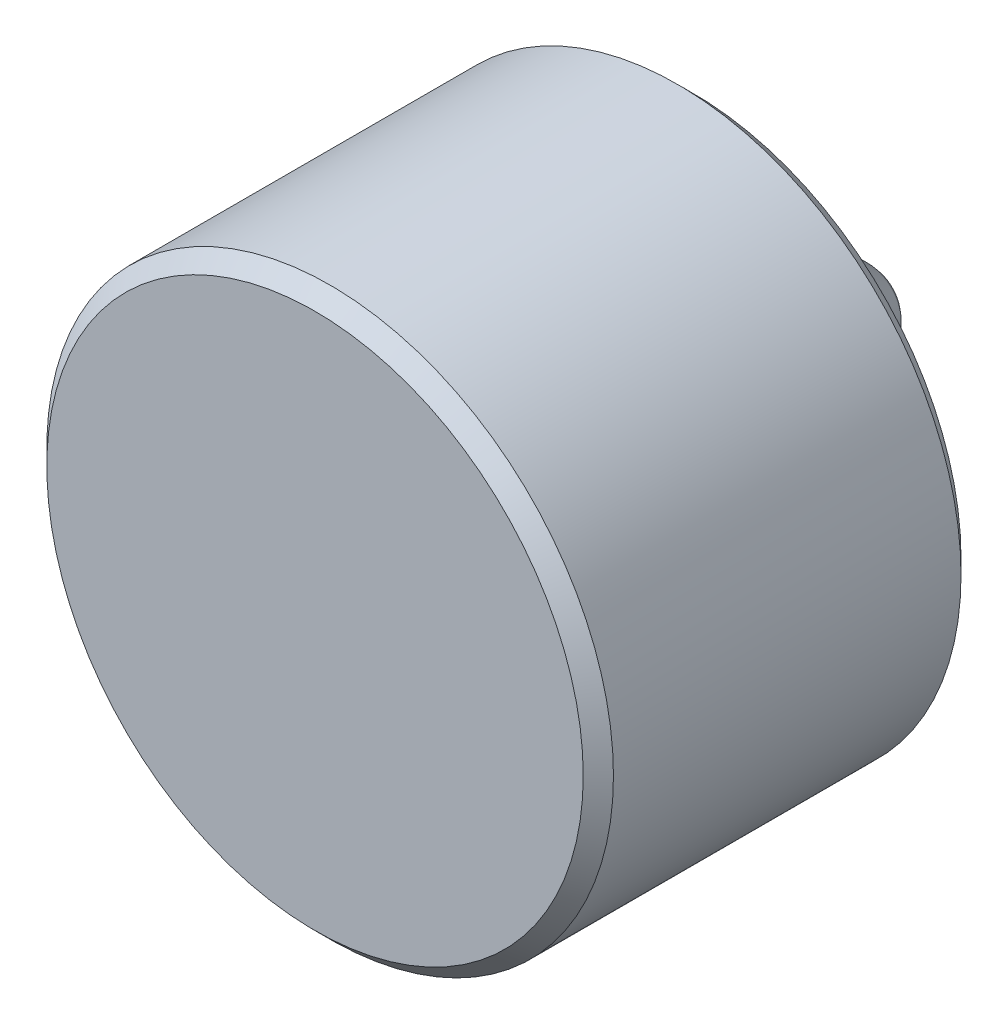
ISO-10303-21;
HEADER;
FILE_DESCRIPTION(('STEP AP214'),'2;1');
FILE_NAME('part.step','',(''),(''),'','','');
FILE_SCHEMA(('AUTOMOTIVE_DESIGN { 1 0 10303 214 1 1 1 1 }'));
ENDSEC;
DATA;
#1=APPLICATION_CONTEXT('core data for automotive mechanical design processes');
#2=APPLICATION_PROTOCOL_DEFINITION('international standard','automotive_design',2000,#1);
#3=PRODUCT_CONTEXT('',#1,'mechanical');
#4=PRODUCT('Part','Part','',(#3));
#5=PRODUCT_RELATED_PRODUCT_CATEGORY('part','',(#4));
#6=PRODUCT_DEFINITION_FORMATION('','',#4);
#7=PRODUCT_DEFINITION_CONTEXT('part definition',#1,'design');
#8=PRODUCT_DEFINITION('design','',#6,#7);
#9=PRODUCT_DEFINITION_SHAPE('','',#8);
#10=(LENGTH_UNIT() NAMED_UNIT(*) SI_UNIT(.MILLI.,.METRE.));
#11=(NAMED_UNIT(*) PLANE_ANGLE_UNIT() SI_UNIT($,.RADIAN.));
#12=(NAMED_UNIT(*) SI_UNIT($,.STERADIAN.) SOLID_ANGLE_UNIT());
#13=UNCERTAINTY_MEASURE_WITH_UNIT(LENGTH_MEASURE(1.E-05),#10,'distance_accuracy_value','');
#14=(GEOMETRIC_REPRESENTATION_CONTEXT(3) GLOBAL_UNCERTAINTY_ASSIGNED_CONTEXT((#13)) GLOBAL_UNIT_ASSIGNED_CONTEXT((#10,
#11,#12)) REPRESENTATION_CONTEXT('',''));
#15=CARTESIAN_POINT('',(0.,0.,0.));
#16=DIRECTION('',(0.,0.,1.));
#17=DIRECTION('',(1.,0.,0.));
#18=AXIS2_PLACEMENT_3D('',#15,#16,#17);
#19=CARTESIAN_POINT('',(0.,0.,0.));
#20=DIRECTION('',(0.,0.,-1.));
#21=DIRECTION('',(-1.,0.,0.));
#22=AXIS2_PLACEMENT_3D('',#19,#20,#21);
#23=PLANE('',#22);
#24=CARTESIAN_POINT('',(0.,0.,0.));
#25=DIRECTION('',(0.,0.,1.));
#26=DIRECTION('',(1.,0.,0.));
#27=AXIS2_PLACEMENT_3D('',#24,#25,#26);
#28=CIRCLE('',#27,4.5085);
#29=CARTESIAN_POINT('',(4.5085,0.,0.));
#30=VERTEX_POINT('',#29);
#31=EDGE_CURVE('E10',#30,#30,#28,.T.);
#32=ORIENTED_EDGE('',*,*,#31,.T.);
#33=EDGE_LOOP('',(#32));
#34=FACE_BOUND('',#33,.T.);
#35=ADVANCED_FACE('F33',(#34),#23,.F.);
#36=CARTESIAN_POINT('',(0.,0.,-0.254));
#37=DIRECTION('',(0.,0.,-1.));
#38=DIRECTION('',(-1.,0.,0.));
#39=AXIS2_PLACEMENT_3D('',#36,#37,#38);
#40=CONICAL_SURFACE('',#39,4.7625,0.785398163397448);
#41=ORIENTED_EDGE('',*,*,#31,.F.);
#42=EDGE_LOOP('',(#41));
#43=FACE_BOUND('',#42,.T.);
#44=CARTESIAN_POINT('',(0.,0.,-0.254));
#45=DIRECTION('',(0.,0.,1.));
#46=DIRECTION('',(1.,0.,0.));
#47=AXIS2_PLACEMENT_3D('',#44,#45,#46);
#48=CIRCLE('',#47,4.7625);
#49=CARTESIAN_POINT('',(4.7625,0.,-0.254));
#50=VERTEX_POINT('',#49);
#51=EDGE_CURVE('E39',#50,#50,#48,.T.);
#52=ORIENTED_EDGE('',*,*,#51,.T.);
#53=EDGE_LOOP('',(#52));
#54=FACE_BOUND('',#53,.T.);
#55=ADVANCED_FACE('F71',(#43,#54),#40,.T.);
#56=CARTESIAN_POINT('',(0.,0.,0.));
#57=DIRECTION('',(0.,0.,1.));
#58=DIRECTION('',(1.,0.,0.));
#59=AXIS2_PLACEMENT_3D('',#56,#57,#58);
#60=CYLINDRICAL_SURFACE('',#59,4.7625);
#61=ORIENTED_EDGE('',*,*,#51,.F.);
#62=EDGE_LOOP('',(#61));
#63=FACE_BOUND('',#62,.T.);
#64=CARTESIAN_POINT('',(0.,0.,-6.096));
#65=DIRECTION('',(0.,0.,1.));
#66=DIRECTION('',(1.,0.,0.));
#67=AXIS2_PLACEMENT_3D('',#64,#65,#66);
#68=CIRCLE('',#67,4.7625);
#69=CARTESIAN_POINT('',(4.7625,0.,-6.096));
#70=VERTEX_POINT('',#69);
#71=EDGE_CURVE('E43',#70,#70,#68,.T.);
#72=ORIENTED_EDGE('',*,*,#71,.T.);
#73=EDGE_LOOP('',(#72));
#74=FACE_BOUND('',#73,.T.);
#75=ADVANCED_FACE('F75',(#63,#74),#60,.T.);
#76=CARTESIAN_POINT('',(0.,0.,-6.35));
#77=DIRECTION('',(0.,0.,1.));
#78=DIRECTION('',(1.,0.,0.));
#79=AXIS2_PLACEMENT_3D('',#76,#77,#78);
#80=CONICAL_SURFACE('',#79,4.5085,0.785398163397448);
#81=ORIENTED_EDGE('',*,*,#71,.F.);
#82=EDGE_LOOP('',(#81));
#83=FACE_BOUND('',#82,.T.);
#84=CARTESIAN_POINT('',(0.,0.,-6.35));
#85=DIRECTION('',(0.,0.,1.));
#86=DIRECTION('',(1.,0.,0.));
#87=AXIS2_PLACEMENT_3D('',#84,#85,#86);
#88=CIRCLE('',#87,4.5085);
#89=CARTESIAN_POINT('',(4.5085,0.,-6.35));
#90=VERTEX_POINT('',#89);
#91=EDGE_CURVE('E47',#90,#90,#88,.T.);
#92=ORIENTED_EDGE('',*,*,#91,.T.);
#93=EDGE_LOOP('',(#92));
#94=FACE_BOUND('',#93,.T.);
#95=ADVANCED_FACE('F80',(#83,#94),#80,.T.);
#96=CARTESIAN_POINT('',(0.,4.5085,-6.35));
#97=DIRECTION('',(0.,0.,1.));
#98=DIRECTION('',(1.,0.,0.));
#99=AXIS2_PLACEMENT_3D('',#96,#97,#98);
#100=PLANE('',#99);
#101=ORIENTED_EDGE('',*,*,#91,.F.);
#102=EDGE_LOOP('',(#101));
#103=FACE_BOUND('',#102,.T.);
#104=CARTESIAN_POINT('',(0.,0.,-6.35));
#105=DIRECTION('',(0.,0.,1.));
#106=DIRECTION('',(1.,0.,0.));
#107=AXIS2_PLACEMENT_3D('',#104,#105,#106);
#108=CIRCLE('',#107,3.50378201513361);
#109=CARTESIAN_POINT('',(3.50378201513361,0.,-6.35));
#110=VERTEX_POINT('',#109);
#111=EDGE_CURVE('E52',#110,#110,#108,.T.);
#112=ORIENTED_EDGE('',*,*,#111,.T.);
#113=EDGE_LOOP('',(#112));
#114=FACE_BOUND('',#113,.T.);
#115=ADVANCED_FACE('F67',(#103,#114),#100,.F.);
#116=CARTESIAN_POINT('',(0.,0.,-9.29251600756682));
#117=DIRECTION('',(0.,0.,1.));
#118=DIRECTION('',(1.,0.,0.));
#119=AXIS2_PLACEMENT_3D('',#116,#117,#118);
#120=CONICAL_SURFACE('',#119,0.561266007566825,0.785398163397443);
#121=CARTESIAN_POINT('',(0.,0.,-9.29251600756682));
#122=DIRECTION('',(0.,0.,1.));
#123=DIRECTION('',(1.,0.,0.));
#124=AXIS2_PLACEMENT_3D('',#121,#122,#123);
#125=CIRCLE('',#124,0.561266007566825);
#126=CARTESIAN_POINT('',(0.561266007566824,0.,-9.29251600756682));
#127=VERTEX_POINT('',#126);
#128=EDGE_CURVE('E55',#127,#127,#125,.T.);
#129=CARTESIAN_POINT('',(3.50378201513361,0.,-6.35));
#130=CARTESIAN_POINT('',(3.47313080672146,0.,-6.38065120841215));
#131=CARTESIAN_POINT('',(3.4424795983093,0.,-6.41130241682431));
#132=CARTESIAN_POINT('',(3.381177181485,0.,-6.47260483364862));
#133=CARTESIAN_POINT('',(3.35052597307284,0.,-6.50325604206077));
#134=CARTESIAN_POINT('',(3.28922355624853,0.,-6.56455845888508));
#135=CARTESIAN_POINT('',(3.25857234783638,0.,-6.59520966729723));
#136=CARTESIAN_POINT('',(3.19726993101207,0.,-6.65651208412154));
#137=CARTESIAN_POINT('',(3.16661872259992,0.,-6.6871632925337));
#138=CARTESIAN_POINT('',(3.10531630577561,0.,-6.74846570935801));
#139=CARTESIAN_POINT('',(3.07466509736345,0.,-6.77911691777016));
#140=CARTESIAN_POINT('',(3.01336268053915,0.,-6.84041933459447));
#141=CARTESIAN_POINT('',(2.98271147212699,0.,-6.87107054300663));
#142=CARTESIAN_POINT('',(2.92140905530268,0.,-6.93237295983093));
#143=CARTESIAN_POINT('',(2.89075784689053,0.,-6.96302416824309));
#144=CARTESIAN_POINT('',(2.82945543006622,0.,-7.0243265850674));
#145=CARTESIAN_POINT('',(2.79880422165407,0.,-7.05497779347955));
#146=CARTESIAN_POINT('',(2.73750180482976,0.,-7.11628021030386));
#147=CARTESIAN_POINT('',(2.70685059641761,0.,-7.14693141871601));
#148=CARTESIAN_POINT('',(2.6455481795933,0.,-7.20823383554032));
#149=CARTESIAN_POINT('',(2.61489697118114,0.,-7.23888504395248));
#150=CARTESIAN_POINT('',(2.55359455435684,0.,-7.30018746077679));
#151=CARTESIAN_POINT('',(2.52294334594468,0.,-7.33083866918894));
#152=CARTESIAN_POINT('',(2.46164092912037,0.,-7.39214108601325));
#153=CARTESIAN_POINT('',(2.43098972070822,0.,-7.4227922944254));
#154=CARTESIAN_POINT('',(2.36968730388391,0.,-7.48409471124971));
#155=CARTESIAN_POINT('',(2.33903609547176,0.,-7.51474591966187));
#156=CARTESIAN_POINT('',(2.27773367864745,0.,-7.57604833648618));
#157=CARTESIAN_POINT('',(2.2470824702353,0.,-7.60669954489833));
#158=CARTESIAN_POINT('',(2.18578005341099,0.,-7.66800196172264));
#159=CARTESIAN_POINT('',(2.15512884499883,0.,-7.69865317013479));
#160=CARTESIAN_POINT('',(2.09382642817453,0.,-7.7599555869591));
#161=CARTESIAN_POINT('',(2.06317521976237,0.,-7.79060679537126));
#162=CARTESIAN_POINT('',(2.00187280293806,0.,-7.85190921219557));
#163=CARTESIAN_POINT('',(1.97122159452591,0.,-7.88256042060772));
#164=CARTESIAN_POINT('',(1.9099191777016,0.,-7.94386283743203));
#165=CARTESIAN_POINT('',(1.87926796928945,0.,-7.97451404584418));
#166=CARTESIAN_POINT('',(1.81796555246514,0.,-8.03581646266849));
#167=CARTESIAN_POINT('',(1.78731434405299,0.,-8.06646767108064));
#168=CARTESIAN_POINT('',(1.72601192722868,0.,-8.12777008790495));
#169=CARTESIAN_POINT('',(1.69536071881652,0.,-8.15842129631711));
#170=CARTESIAN_POINT('',(1.63405830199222,0.,-8.21972371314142));
#171=CARTESIAN_POINT('',(1.60340709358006,0.,-8.25037492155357));
#172=CARTESIAN_POINT('',(1.54210467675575,0.,-8.31167733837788));
#173=CARTESIAN_POINT('',(1.5114534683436,0.,-8.34232854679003));
#174=CARTESIAN_POINT('',(1.45015105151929,0.,-8.40363096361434));
#175=CARTESIAN_POINT('',(1.41949984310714,0.,-8.4342821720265));
#176=CARTESIAN_POINT('',(1.35819742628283,0.,-8.49558458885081));
#177=CARTESIAN_POINT('',(1.32754621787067,0.,-8.52623579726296));
#178=CARTESIAN_POINT('',(1.26624380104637,0.,-8.58753821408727));
#179=CARTESIAN_POINT('',(1.23559259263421,0.,-8.61818942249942));
#180=CARTESIAN_POINT('',(1.1742901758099,0.,-8.67949183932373));
#181=CARTESIAN_POINT('',(1.14363896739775,0.,-8.71014304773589));
#182=CARTESIAN_POINT('',(1.08233655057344,0.,-8.7714454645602));
#183=CARTESIAN_POINT('',(1.05168534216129,0.,-8.80209667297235));
#184=CARTESIAN_POINT('',(0.990382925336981,0.,-8.86339908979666));
#185=CARTESIAN_POINT('',(0.959731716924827,0.,-8.89405029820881));
#186=CARTESIAN_POINT('',(0.898429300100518,0.,-8.95535271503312));
#187=CARTESIAN_POINT('',(0.867778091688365,0.,-8.98600392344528));
#188=CARTESIAN_POINT('',(0.806475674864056,0.,-9.04730634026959));
#189=CARTESIAN_POINT('',(0.775824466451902,0.,-9.07795754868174));
#190=CARTESIAN_POINT('',(0.714522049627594,0.,-9.13925996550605));
#191=CARTESIAN_POINT('',(0.68387084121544,0.,-9.1699111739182));
#192=CARTESIAN_POINT('',(0.622568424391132,0.,-9.23121359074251));
#193=CARTESIAN_POINT('',(0.591917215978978,0.,-9.26186479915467));
#194=CARTESIAN_POINT('',(0.561266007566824,0.,-9.29251600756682));
#195=B_SPLINE_CURVE_WITH_KNOTS('',3,(#129,#130,#131,#132,#133,#134,#135,#136,#137,#138,#139,
#140,#141,#142,#143,#144,#145,#146,#147,#148,#149,#150,#151,#152,#153,#154,#155,#156,#157,#158,
#159,#160,#161,#162,#163,#164,#165,#166,#167,#168,#169,#170,#171,#172,#173,#174,#175,#176,#177,
#178,#179,#180,#181,#182,#183,#184,#185,#186,#187,#188,#189,#190,#191,#192,#193,#194),
.UNSPECIFIED.,.F.,.F.,(4,2,2,2,2,2,2,2,2,2,2,2,2,2,2,2,2,2,2,2,2,2,2,2,2,2,2,2,2,2,2,2,4),(0.,
0.130042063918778,0.260084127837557,0.390126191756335,0.520168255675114,0.650210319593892,
0.78025238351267,0.910294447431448,1.04033651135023,1.17037857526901,1.30042063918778,
1.43046270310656,1.56050476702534,1.69054683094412,1.8205888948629,1.95063095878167,
2.08067302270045,2.21071508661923,2.34075715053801,2.47079921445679,2.60084127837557,
2.73088334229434,2.86092540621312,2.9909674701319,3.12100953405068,3.25105159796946,
3.38109366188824,3.51113572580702,3.64117778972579,3.77121985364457,3.90126191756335,
4.03130398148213,4.16134604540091),.UNSPECIFIED.);
#196=EDGE_CURVE('BSEAM59',#110,#127,#195,.T.);
#197=ORIENTED_EDGE('',*,*,#111,.F.);
#198=ORIENTED_EDGE('',*,*,#128,.T.);
#199=ORIENTED_EDGE('',*,*,#196,.T.);
#200=ORIENTED_EDGE('',*,*,#196,.F.);
#201=EDGE_LOOP('',(#197,#199,#198,#200));
#202=FACE_BOUND('',#201,.T.);
#203=ADVANCED_FACE('F59',(#202),#120,.T.);
#204=CARTESIAN_POINT('',(0.,0.,-8.73125));
#205=DIRECTION('',(0.,0.,1.));
#206=DIRECTION('',(0.,1.,0.));
#207=AXIS2_PLACEMENT_3D('',#204,#205,#206);
#208=SPHERICAL_SURFACE('',#207,0.79375);
#209=ORIENTED_EDGE('',*,*,#128,.F.);
#210=EDGE_LOOP('',(#209));
#211=FACE_BOUND('',#210,.T.);
#212=ADVANCED_FACE('F61',(#211),#208,.T.);
#213=CLOSED_SHELL('',(#35,#55,#75,#95,#115,#203,#212));
#214=MANIFOLD_SOLID_BREP('B2',#213);
#215=ADVANCED_BREP_SHAPE_REPRESENTATION('',(#18,#214),#14);
#216=SHAPE_DEFINITION_REPRESENTATION(#9,#215);
ENDSEC;
END-ISO-10303-21;
